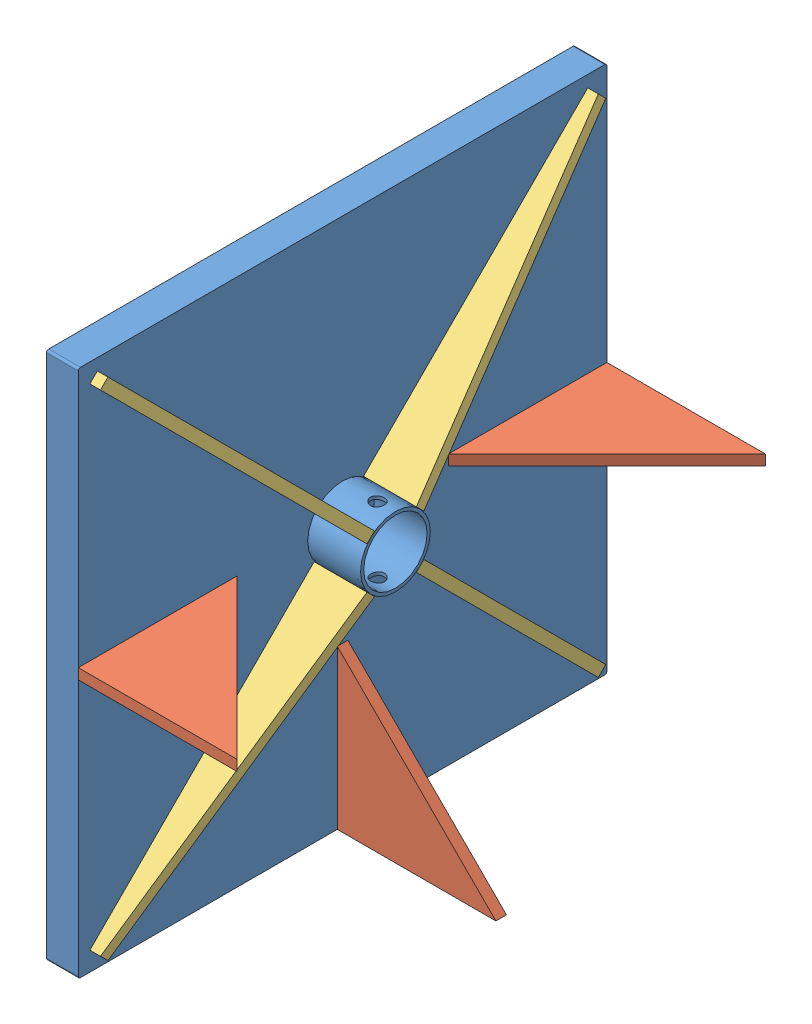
SolidWorks assembly assemblage plaque de pression.SLDASM, configuration Défaut (file format 7000). Lengths in mm.
Overall size (180 500 500).
8 component instances, 3 part files, 21 mates.
Components (placement in the parent):
- plaque pression-1: plaque pression.SLDPRT [Défaut] at (1515.96 1286.5672 -10.2204) x (0 0 1) z (1 0 0) size (500 500 80)
- equerre renfort-1: equerre renfort.SLDPRT [Défaut] at (1545.96 1291.5672 89.7796) x (0 0 1) z (0 -1 0) size (150 150 10)
- equerre renfort-2: equerre renfort.SLDPRT [Défaut] at (1545.96 1281.5672 -110.2204) x (0 0 -1) z (0 1 0) size (150 150 10)
- equerre renfort-3: equerre renfort.SLDPRT [Défaut] at (1545.96 1186.5672 -5.2204) x (0 -1 0) z (0 0 -1) size (150 150 10)
- renfort plaque-1: renfort plaque.SLDPRT [Défaut] at (1545.96 1266.7682 -37.0905) x (0 -0.707107 -0.707107) z (0 -0.707107 0.707107) size (300 50 10)
- renfort plaque-2: renfort plaque.SLDPRT [Défaut] at (1545.96 1259.6972 9.5786) x (0 -0.707107 0.707107) z (0 0.707107 0.707107) size (300 50 10)
- renfort plaque-3: renfort plaque.SLDPRT [Défaut] at (1545.96 1313.4373 -30.0194) x (0 0.707107 -0.707107) z (0 -0.707107 -0.707107) size (300 50 10)
- renfort plaque-4: renfort plaque.SLDPRT [Défaut] at (1545.96 1306.3662 16.6496) x (0 0.707107 0.707107) z (0 0.707107 -0.707107) size (300 50 10)
Mates (geometry in assembly coordinates):
- Coïncidente92: coincident anti-aligned: plane of plaque pression-1 through (1545.96 1286.5672 -10.2204) normal (1 0 0); plane of renfort plaque-1 through (1545.96 1259.6972 -30.0194) normal (-1 0 0)
- Coïncidente93: coincident aligned: line of plaque pression-1 through (1545.96 1036.5672 -260.2204) axis (0 0.707107 0.707107); line of renfort plaque-1 through (1545.96 1051.1007 -245.687) axis (0 0.707107 0.707107)
- Tangent5: tangent anti-aligned: cylinder of plaque pression-1 through (1595.96 1286.5672 -10.2204) axis (-1 0 0) radius 33; plane of renfort plaque-1 through (1595.96 1259.6972 -30.0194) normal (0 0.707107 0.707107)
- Coïncidente94: coincident anti-aligned: plane of plaque pression-1 through (1545.96 1286.5672 -10.2204) normal (1 0 0); plane of renfort plaque-2 through (1545.96 1266.7682 16.6496) normal (-1 0 0)
- Coïncidente95: coincident aligned: line of plaque pression-1 through (1545.96 1036.5672 239.7796) axis (0 0.707107 -0.707107); line of renfort plaque-2 through (1545.96 1051.1007 225.2461) axis (0 0.707107 -0.707107)
- Tangent6: tangent anti-aligned: cylinder of plaque pression-1 through (1595.96 1286.5672 -10.2204) axis (-1 0 0) radius 33; plane of renfort plaque-2 through (1595.96 1266.7682 16.6496) normal (0 0.707107 -0.707107)
- Coïncidente96: coincident anti-aligned: line of plaque pression-1 through (1545.96 1036.5672 239.7796) axis (0 0.707107 -0.707107); line of renfort plaque-3 through (1545.96 1522.0338 -245.687) axis (0 -0.707107 0.707107)
- Coïncidente97: coincident anti-aligned: plane of plaque pression-1 through (1545.96 1286.5672 -10.2204) normal (1 0 0); plane of renfort plaque-3 through (1545.96 1306.3662 -37.0905) normal (-1 0 0)
- Tangent7: tangent anti-aligned: cylinder of plaque pression-1 through (1595.96 1286.5672 -10.2204) axis (-1 0 0) radius 33; plane of renfort plaque-3 through (1595.96 1306.3662 -37.0905) normal (0 -0.707107 0.707107)
- Coïncidente99: coincident anti-aligned: plane of plaque pression-1 through (1545.96 1286.5672 -10.2204) normal (1 0 0); plane of renfort plaque-4 through (1545.96 1313.4373 9.5786) normal (-1 0 0)
- Coïncidente100: coincident anti-aligned: line of plaque pression-1 through (1545.96 1036.5672 -260.2204) axis (0 0.707107 0.707107); line of renfort plaque-4 through (1545.96 1522.0338 225.2461) axis (0 -0.707107 -0.707107)
- Tangent8: tangent anti-aligned: cylinder of plaque pression-1 through (1595.96 1286.5672 -10.2204) axis (-1 0 0) radius 33; plane of renfort plaque-4 through (1595.96 1313.4373 9.5786) normal (0 -0.707107 -0.707107)
- Coïncidente206: coincident anti-aligned: plane of plaque pression-1 through (1545.96 1286.5672 -10.2204) normal (1 0 0); plane of equerre renfort-1 through (1545.96 1281.5672 89.7796) normal (-1 0 0)
- Coïncidente207: coincident anti-aligned: line of plaque pression-1 through (1545.96 1534.5672 239.7796) axis (0 -1 0); line of equerre renfort-1 through (1545.96 1281.5672 239.7796) axis (0 1 0)
- Distance10: distance = 245 mm aligned: plane of equerre renfort-1 through (1545.96 1291.5672 89.7796) normal (0 1 0); plane of plaque pression-1 through (1545.96 1536.5672 -260.2204) normal (0 1 0)
- Coïncidente209: coincident anti-aligned: plane of plaque pression-1 through (1545.96 1286.5672 -10.2204) normal (1 0 0); plane of equerre renfort-2 through (1545.96 1291.5672 -110.2204) normal (-1 0 0)
- Coïncidente210: coincident anti-aligned: line of plaque pression-1 through (1545.96 1038.5672 -260.2204) axis (0 1 0); line of equerre renfort-2 through (1545.96 1291.5672 -260.2204) axis (0 -1 0)
- Distance11: distance = 245 mm aligned: plane of equerre renfort-2 through (1545.96 1291.5672 -110.2204) normal (0 1 0); plane of plaque pression-1 through (1545.96 1536.5672 -260.2204) normal (0 1 0)
- Coïncidente212: coincident anti-aligned: plane of plaque pression-1 through (1545.96 1286.5672 -10.2204) normal (1 0 0); plane of equerre renfort-3 through (1545.96 1186.5672 -15.2204) normal (-1 0 0)
- Coïncidente213: coincident anti-aligned: line of plaque pression-1 through (1545.96 1036.5672 237.7796) axis (0 0 -1); line of equerre renfort-3 through (1545.96 1036.5672 -15.2204) axis (0 0 1)
- Distance12: distance = 245 mm aligned: plane of equerre renfort-3 through (1545.96 1186.5672 -5.2204) normal (0 0 1); plane of plaque pression-1 through (1545.96 1036.5672 239.7796) normal (0 0 1)
